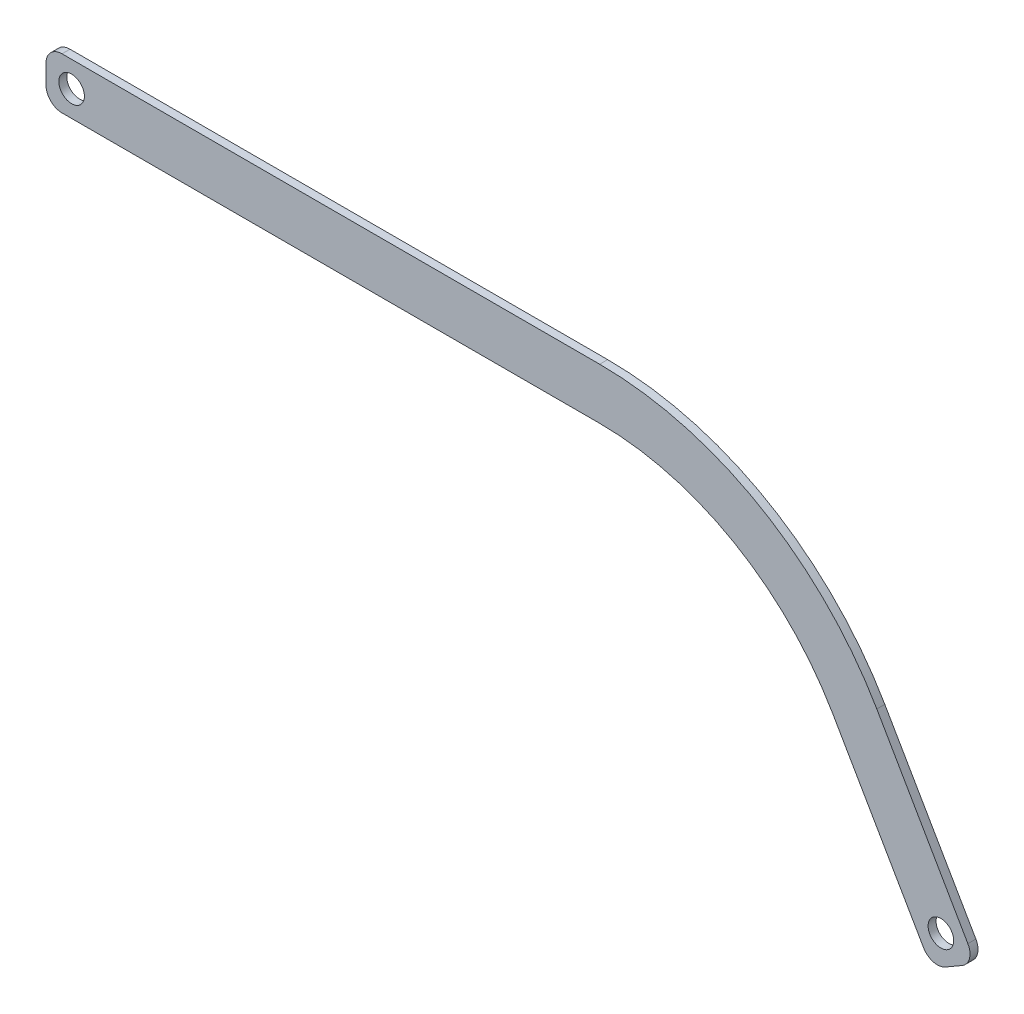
from build123d import *

# Parameters (mm, degrees)
ESQUISSE1_R      = 8
EXTRUSION1_DEPTH = 5


with BuildPart() as part:
    # Esquisse1 → Extrusion1 (new body)
    with BuildSketch(Plane.XY):
        with BuildLine():
            Line((-6, 16), (330, 16))
            ThreePointArc((330, 16), (430, -10.794919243), (503.205080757, -84))
            Line((503.205080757, -84), (560.104768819, -182.553150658))
            ThreePointArc((560.104768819, -182.553150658), (561.103773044, -190.141341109), (556.444514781, -196.213404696))
            Line((556.444514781, -196.213404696), (546.052209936, -202.213404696))
            ThreePointArc((546.052209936, -202.213404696), (538.464019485, -203.212408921), (532.391955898, -198.553150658))
            Line((532.391955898, -198.553150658), (475.492267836, -100))
            ThreePointArc((475.492267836, -100), (414, -38.507732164), (330, -16))
            Line((330, -16), (-6, -16))
            ThreePointArc((-6, -16), (-13.071067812, -13.071067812), (-16, -6))
            Line((-16, -6), (-16, 6))
            ThreePointArc((-16, 6), (-13.071067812, 13.071067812), (-6, 16))
        make_face()
        Circle(ESQUISSE1_R, mode=Mode.SUBTRACT)
        with Locations((543.248362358, -185.356998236)):
            Circle(ESQUISSE1_R, mode=Mode.SUBTRACT)
    extrude(amount=-EXTRUSION1_DEPTH)


solid = part.part
